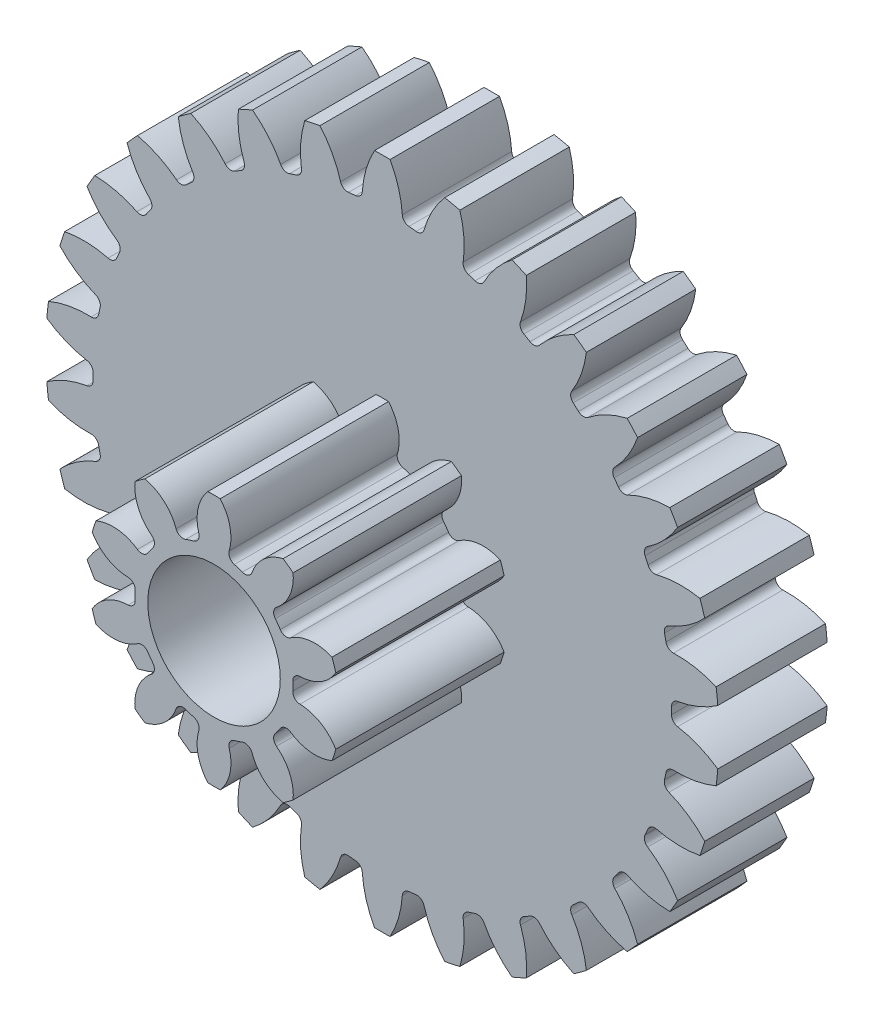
from build123d import *

# Parameters (mm, degrees)
BOSS_EXTRU_1_DEPTH                 = 2.6
CONG_1_R                           = 0.175
R_P_TITION_CIRCULAIRE4_COUNT       = 30
CONG_1_OF_R_P_TITION_CIRCULAIRE4_R = 0.175
BOSS_EXTRU_2_DEPTH                 = 4
CONG_2_R                           = 0.175
R_P_TITION_CIRCULAIRE5_COUNT       = 10
CONG_2_OF_R_P_TITION_CIRCULAIRE5_R = 0.175
ESQUISSE10_R                       = 1.575
ENL_V_MAT_EXTRU_4_DEPTH            = 15.293363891


with BuildPart() as part:
    # Esquisse3 → Boss.-Extru.1 (new body)
    with BuildSketch(Plane.XY):
        with BuildLine():
            Line((-2.097340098, 6.276985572), (-1.378706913, -0.560352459))
            Line((-1.378706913, -0.560352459), (-0.660073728, 6.276985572))
            ThreePointArc((-0.660073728, 6.276985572), (-0.778877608, 6.288430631), (-0.897862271, 6.29781154))
            ThreePointArc((-0.897862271, 6.29781154), (-0.974546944, 6.88628764), (-1.194373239, 7.437523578))
            ThreePointArc((-1.194373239, 7.437523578), (-1.378706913, 7.439647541), (-1.563040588, 7.437523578))
            ThreePointArc((-1.563040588, 7.437523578), (-1.782866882, 6.88628764), (-1.859551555, 6.29781154))
            ThreePointArc((-1.859551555, 6.29781154), (-1.978536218, 6.288430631), (-2.097340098, 6.276985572))
        make_face()
    boss_extru_1 = extrude(amount=BOSS_EXTRU_1_DEPTH)

    # Cong_1
    cong_1_edges = [part.edges().sort_by_distance(p)[0] for p in [
        (-1.859551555, 6.29781154, 1.3),
        (-0.897862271, 6.29781154, 1.3),
    ]]
    fillet(cong_1_edges, radius=CONG_1_R)

    # R_p_tition circulaire4: Boss.-Extru.1 ×30 about axis
    r_p_tition_circulaire4_axis = Axis((-1.378706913, -0.560352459, 0), (0, 0, 1))
    for i in range(1, R_P_TITION_CIRCULAIRE4_COUNT):
        add(boss_extru_1.rotate(r_p_tition_circulaire4_axis, i * 360 / R_P_TITION_CIRCULAIRE4_COUNT))

    # Cong_1 of R_p_tition circulaire4
    cong_1_of_r_p_tition_circulaire4_edges = [part.edges().sort_by_distance(p)[0] for p in [
        (-3.274936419, 6.047970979, 1.3),
        (-2.334262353, 6.247917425, 1.3),
        (-4.607446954, 5.509314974, 1.3),
        (-3.728900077, 5.900469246, 1.3),
        (-5.798846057, 4.705385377, 1.3),
        (-5.020823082, 5.270652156, 1.3),
        (-6.797063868, 3.671317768, 1.3),
        (-6.153568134, 4.385992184, 1.3),
        (-7.55847348, 2.452305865, 1.3),
        (-7.077628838, 3.285153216, 1.3),
        (-8.04979764, 1.101626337, 1.3),
        (-7.752619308, 2.016247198, 1.3),
        (-8.249563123, -0.32168964, 1.3),
        (-8.14903922, 0.63473141, 1.3),
        (-8.14903922, -1.755436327, 1.3),
        (-8.249563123, -0.799015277, 1.3),
        (-7.752619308, -3.136952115, 1.3),
        (-8.04979764, -2.222331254, 1.3),
        (-7.077628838, -4.405858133, 1.3),
        (-7.55847348, -3.573010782, 1.3),
        (-6.153568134, -5.506697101, 1.3),
        (-6.797063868, -4.792022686, 1.3),
        (-5.020823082, -6.391357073, 1.3),
        (-5.798846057, -5.826090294, 1.3),
        (-3.728900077, -7.021174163, 1.3),
        (-4.607446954, -6.630019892, 1.3),
        (-2.334262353, -7.368622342, 1.3),
        (-3.274936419, -7.168675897, 1.3),
        (-0.897862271, -7.418516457, 1.3),
        (-1.859551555, -7.418516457, 1.3),
        (0.517522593, -7.168675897, 1.3),
        (-0.423151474, -7.368622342, 1.3),
        (1.850033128, -6.630019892, 1.3),
        (0.97148625, -7.021174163, 1.3),
        (3.04143223, -5.826090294, 1.3),
        (2.263409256, -6.391357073, 1.3),
        (4.039650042, -4.792022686, 1.3),
        (3.396154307, -5.506697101, 1.3),
        (4.801059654, -3.573010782, 1.3),
        (4.320215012, -4.405858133, 1.3),
        (5.292383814, -2.222331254, 1.3),
        (4.995205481, -3.136952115, 1.3),
        (5.492149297, -0.799015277, 1.3),
        (5.391625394, -1.755436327, 1.3),
        (5.391625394, 0.63473141, 1.3),
        (5.492149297, -0.32168964, 1.3),
        (4.995205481, 2.016247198, 1.3),
        (5.292383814, 1.101626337, 1.3),
        (4.320215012, 3.285153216, 1.3),
        (4.801059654, 2.452305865, 1.3),
        (3.396154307, 4.385992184, 1.3),
        (4.039650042, 3.671317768, 1.3),
        (2.263409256, 5.270652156, 1.3),
        (3.04143223, 4.705385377, 1.3),
        (0.97148625, 5.900469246, 1.3),
        (1.850033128, 5.509314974, 1.3),
        (-0.423151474, 6.247917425, 1.3),
        (0.517522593, 6.047970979, 1.3),
    ]]
    fillet(cong_1_of_r_p_tition_circulaire4_edges, radius=CONG_1_OF_R_P_TITION_CIRCULAIRE4_R)

    # Esquisse8 → Boss.-Extru.2 (add)
    with BuildSketch(Plane.XY.offset(2.6)):
        with BuildLine():
            Line((-1.958113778, 1.222878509), (-1.378706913, -0.560352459))
            Line((-1.378706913, -0.560352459), (-0.799300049, 1.222878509))
            ThreePointArc((-0.799300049, 1.222878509), (-0.942925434, 1.263303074), (-1.089310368, 1.292179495))
            ThreePointArc((-1.089310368, 1.292179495), (-0.984517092, 1.886051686), (-1.231837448, 2.436050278))
            ThreePointArc((-1.231837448, 2.436050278), (-1.378706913, 2.439647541), (-1.525576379, 2.436050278))
            ThreePointArc((-1.525576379, 2.436050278), (-1.772896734, 1.886051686), (-1.668103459, 1.292179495))
            ThreePointArc((-1.668103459, 1.292179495), (-1.814488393, 1.263303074), (-1.958113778, 1.222878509))
        make_face()
    boss_extru_2 = extrude(amount=BOSS_EXTRU_2_DEPTH)

    # Cong_2
    cong_2_edges = [part.edges().sort_by_distance(p)[0] for p in [
        (-1.089310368, 1.292179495, 4.6),
        (-1.668103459, 1.292179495, 4.6),
    ]]
    fillet(cong_2_edges, radius=CONG_2_R)

    # R_p_tition circulaire5: Boss.-Extru.2 ×10 about axis
    r_p_tition_circulaire5_axis = Axis((-1.378706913, -0.560352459, 0), (0, 0, 1))
    for i in range(1, R_P_TITION_CIRCULAIRE5_COUNT):
        add(boss_extru_2.rotate(r_p_tition_circulaire5_axis, i * 360 / R_P_TITION_CIRCULAIRE5_COUNT))

    # Cong_2 of R_p_tition circulaire5
    cong_2_of_r_p_tition_circulaire5_edges = [part.edges().sort_by_distance(p)[0] for p in [
        (-2.233471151, 1.108480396, 4.6),
        (-2.701724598, 0.768274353, 4.6),
        (-3.051141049, 0.287343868, 4.6),
        (-3.22999795, -0.263121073, 4.6),
        (-3.22999795, -0.857583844, 4.6),
        (-3.051141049, -1.408048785, 4.6),
        (-2.701724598, -1.88897927, 4.6),
        (-2.233471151, -2.229185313, 4.6),
        (-1.668103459, -2.412884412, 4.6),
        (-1.089310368, -2.412884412, 4.6),
        (-0.523942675, -2.229185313, 4.6),
        (-0.055689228, -1.88897927, 4.6),
        (0.293727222, -1.408048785, 4.6),
        (0.472584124, -0.857583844, 4.6),
        (0.472584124, -0.263121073, 4.6),
        (0.293727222, 0.287343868, 4.6),
        (-0.055689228, 0.768274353, 4.6),
        (-0.523942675, 1.108480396, 4.6),
    ]]
    fillet(cong_2_of_r_p_tition_circulaire5_edges, radius=CONG_2_OF_R_P_TITION_CIRCULAIRE5_R)

    # Esquisse10 → Enl_v. mat.-Extru.4 (cut, through all)
    with BuildSketch(Plane.XY):
        with Locations((-1.378706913, -0.560352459)):
            Circle(ESQUISSE10_R)
    extrude(amount=ENL_V_MAT_EXTRU_4_DEPTH, mode=Mode.SUBTRACT)


solid = part.part
